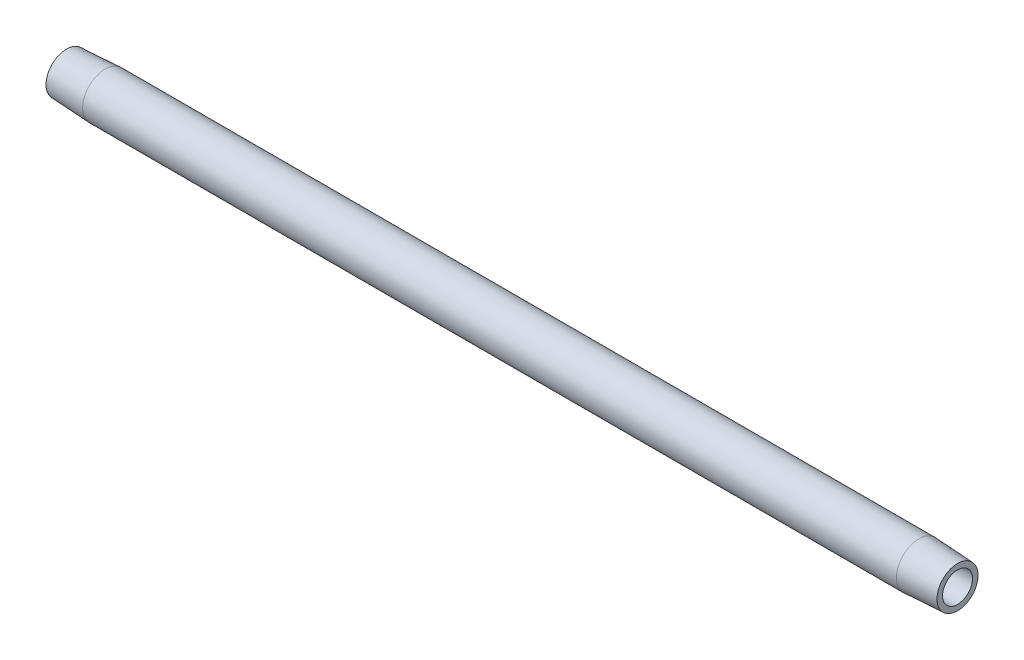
ISO-10303-21;
HEADER;
FILE_DESCRIPTION(('STEP AP214'),'2;1');
FILE_NAME('part.step','',(''),(''),'','','');
FILE_SCHEMA(('AUTOMOTIVE_DESIGN { 1 0 10303 214 1 1 1 1 }'));
ENDSEC;
DATA;
#1=APPLICATION_CONTEXT('core data for automotive mechanical design processes');
#2=APPLICATION_PROTOCOL_DEFINITION('international standard','automotive_design',2000,#1);
#3=PRODUCT_CONTEXT('',#1,'mechanical');
#4=PRODUCT('Part','Part','',(#3));
#5=PRODUCT_RELATED_PRODUCT_CATEGORY('part','',(#4));
#6=PRODUCT_DEFINITION_FORMATION('','',#4);
#7=PRODUCT_DEFINITION_CONTEXT('part definition',#1,'design');
#8=PRODUCT_DEFINITION('design','',#6,#7);
#9=PRODUCT_DEFINITION_SHAPE('','',#8);
#10=(LENGTH_UNIT() NAMED_UNIT(*) SI_UNIT(.MILLI.,.METRE.));
#11=(NAMED_UNIT(*) PLANE_ANGLE_UNIT() SI_UNIT($,.RADIAN.));
#12=(NAMED_UNIT(*) SI_UNIT($,.STERADIAN.) SOLID_ANGLE_UNIT());
#13=UNCERTAINTY_MEASURE_WITH_UNIT(LENGTH_MEASURE(1.E-05),#10,'distance_accuracy_value','');
#14=(GEOMETRIC_REPRESENTATION_CONTEXT(3) GLOBAL_UNCERTAINTY_ASSIGNED_CONTEXT((#13)) GLOBAL_UNIT_ASSIGNED_CONTEXT((#10,
#11,#12)) REPRESENTATION_CONTEXT('',''));
#15=CARTESIAN_POINT('',(0.,0.,0.));
#16=DIRECTION('',(0.,0.,1.));
#17=DIRECTION('',(1.,0.,0.));
#18=AXIS2_PLACEMENT_3D('',#15,#16,#17);
#19=CARTESIAN_POINT('',(0.476141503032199,0.,0.));
#20=DIRECTION('',(-1.,0.,0.));
#21=DIRECTION('',(0.,0.,1.));
#22=AXIS2_PLACEMENT_3D('',#19,#20,#21);
#23=CYLINDRICAL_SURFACE('',#22,5.14349999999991);
#24=CARTESIAN_POINT('',(8.8100393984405,0.,0.));
#25=DIRECTION('',(-1.,0.,0.));
#26=DIRECTION('',(0.,0.,1.));
#27=AXIS2_PLACEMENT_3D('',#24,#25,#26);
#28=CIRCLE('',#27,5.14349999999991);
#29=CARTESIAN_POINT('',(8.8100393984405,0.,5.14349999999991));
#30=VERTEX_POINT('',#29);
#31=EDGE_CURVE('E10',#30,#30,#28,.T.);
#32=ORIENTED_EDGE('',*,*,#31,.F.);
#33=EDGE_LOOP('',(#32));
#34=FACE_BOUND('',#33,.T.);
#35=CARTESIAN_POINT('',(194.389960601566,0.,0.));
#36=DIRECTION('',(-1.,0.,0.));
#37=DIRECTION('',(0.,0.,1.));
#38=AXIS2_PLACEMENT_3D('',#35,#36,#37);
#39=CIRCLE('',#38,5.14349999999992);
#40=CARTESIAN_POINT('',(194.389960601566,0.,5.14349999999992));
#41=VERTEX_POINT('',#40);
#42=EDGE_CURVE('E52',#41,#41,#39,.T.);
#43=ORIENTED_EDGE('',*,*,#42,.T.);
#44=EDGE_LOOP('',(#43));
#45=FACE_BOUND('',#44,.T.);
#46=ADVANCED_FACE('F30',(#34,#45),#23,.T.);
#47=CARTESIAN_POINT('',(8.8100393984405,0.,0.));
#48=DIRECTION('',(1.,0.,0.));
#49=DIRECTION('',(0.,0.,-1.));
#50=AXIS2_PLACEMENT_3D('',#47,#48,#49);
#51=CONICAL_SURFACE('',#50,5.14349999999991,0.0523598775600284);
#52=CARTESIAN_POINT('',(0.,0.,0.));
#53=DIRECTION('',(-1.,0.,0.));
#54=DIRECTION('',(0.,0.,1.));
#55=AXIS2_PLACEMENT_3D('',#52,#53,#54);
#56=CIRCLE('',#55,4.68178539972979);
#57=CARTESIAN_POINT('',(0.,0.,4.68178539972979));
#58=VERTEX_POINT('',#57);
#59=EDGE_CURVE('E36',#58,#58,#56,.T.);
#60=ORIENTED_EDGE('',*,*,#59,.F.);
#61=EDGE_LOOP('',(#60));
#62=FACE_BOUND('',#61,.T.);
#63=ORIENTED_EDGE('',*,*,#31,.T.);
#64=EDGE_LOOP('',(#63));
#65=FACE_BOUND('',#64,.T.);
#66=ADVANCED_FACE('F77',(#62,#65),#51,.T.);
#67=CARTESIAN_POINT('',(0.,4.68178539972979,0.));
#68=DIRECTION('',(1.,0.,0.));
#69=DIRECTION('',(0.,0.,-1.));
#70=AXIS2_PLACEMENT_3D('',#67,#68,#69);
#71=PLANE('',#70);
#72=CARTESIAN_POINT('',(0.,0.,0.));
#73=DIRECTION('',(-1.,0.,0.));
#74=DIRECTION('',(0.,0.,1.));
#75=AXIS2_PLACEMENT_3D('',#72,#73,#74);
#76=CIRCLE('',#75,3.4163);
#77=CARTESIAN_POINT('',(0.,0.,3.4163));
#78=VERTEX_POINT('',#77);
#79=EDGE_CURVE('E40',#78,#78,#76,.T.);
#80=ORIENTED_EDGE('',*,*,#79,.F.);
#81=EDGE_LOOP('',(#80));
#82=FACE_BOUND('',#81,.T.);
#83=ORIENTED_EDGE('',*,*,#59,.T.);
#84=EDGE_LOOP('',(#83));
#85=FACE_BOUND('',#84,.T.);
#86=ADVANCED_FACE('F72',(#82,#85),#71,.F.);
#87=CARTESIAN_POINT('',(0.476141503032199,0.,0.));
#88=DIRECTION('',(-1.,0.,0.));
#89=DIRECTION('',(0.,0.,1.));
#90=AXIS2_PLACEMENT_3D('',#87,#88,#89);
#91=CYLINDRICAL_SURFACE('',#90,3.4163);
#92=CARTESIAN_POINT('',(203.2,0.,0.));
#93=DIRECTION('',(-1.,0.,0.));
#94=DIRECTION('',(0.,0.,1.));
#95=AXIS2_PLACEMENT_3D('',#92,#93,#94);
#96=CIRCLE('',#95,3.41630000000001);
#97=CARTESIAN_POINT('',(203.2,0.,3.41630000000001));
#98=VERTEX_POINT('',#97);
#99=EDGE_CURVE('E44',#98,#98,#96,.T.);
#100=ORIENTED_EDGE('',*,*,#99,.F.);
#101=EDGE_LOOP('',(#100));
#102=FACE_BOUND('',#101,.T.);
#103=ORIENTED_EDGE('',*,*,#79,.T.);
#104=EDGE_LOOP('',(#103));
#105=FACE_BOUND('',#104,.T.);
#106=ADVANCED_FACE('F66',(#102,#105),#91,.F.);
#107=CARTESIAN_POINT('',(203.2,3.41630000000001,0.));
#108=DIRECTION('',(-1.,0.,0.));
#109=DIRECTION('',(0.,0.,1.));
#110=AXIS2_PLACEMENT_3D('',#107,#108,#109);
#111=PLANE('',#110);
#112=CARTESIAN_POINT('',(203.2,0.,0.));
#113=DIRECTION('',(-1.,0.,0.));
#114=DIRECTION('',(0.,0.,1.));
#115=AXIS2_PLACEMENT_3D('',#112,#113,#114);
#116=CIRCLE('',#115,4.68178539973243);
#117=CARTESIAN_POINT('',(203.2,0.,4.68178539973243));
#118=VERTEX_POINT('',#117);
#119=EDGE_CURVE('E49',#118,#118,#116,.T.);
#120=ORIENTED_EDGE('',*,*,#119,.F.);
#121=EDGE_LOOP('',(#120));
#122=FACE_BOUND('',#121,.T.);
#123=ORIENTED_EDGE('',*,*,#99,.T.);
#124=EDGE_LOOP('',(#123));
#125=FACE_BOUND('',#124,.T.);
#126=ADVANCED_FACE('F60',(#122,#125),#111,.F.);
#127=CARTESIAN_POINT('',(203.2,0.,0.));
#128=DIRECTION('',(-1.,0.,0.));
#129=DIRECTION('',(0.,0.,1.));
#130=AXIS2_PLACEMENT_3D('',#127,#128,#129);
#131=CONICAL_SURFACE('',#130,4.68178539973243,0.0523598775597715);
#132=ORIENTED_EDGE('',*,*,#42,.F.);
#133=EDGE_LOOP('',(#132));
#134=FACE_BOUND('',#133,.T.);
#135=ORIENTED_EDGE('',*,*,#119,.T.);
#136=EDGE_LOOP('',(#135));
#137=FACE_BOUND('',#136,.T.);
#138=ADVANCED_FACE('F57',(#134,#137),#131,.T.);
#139=CLOSED_SHELL('',(#46,#66,#86,#106,#126,#138));
#140=MANIFOLD_SOLID_BREP('B2',#139);
#141=ADVANCED_BREP_SHAPE_REPRESENTATION('',(#18,#140),#14);
#142=SHAPE_DEFINITION_REPRESENTATION(#9,#141);
ENDSEC;
END-ISO-10303-21;
